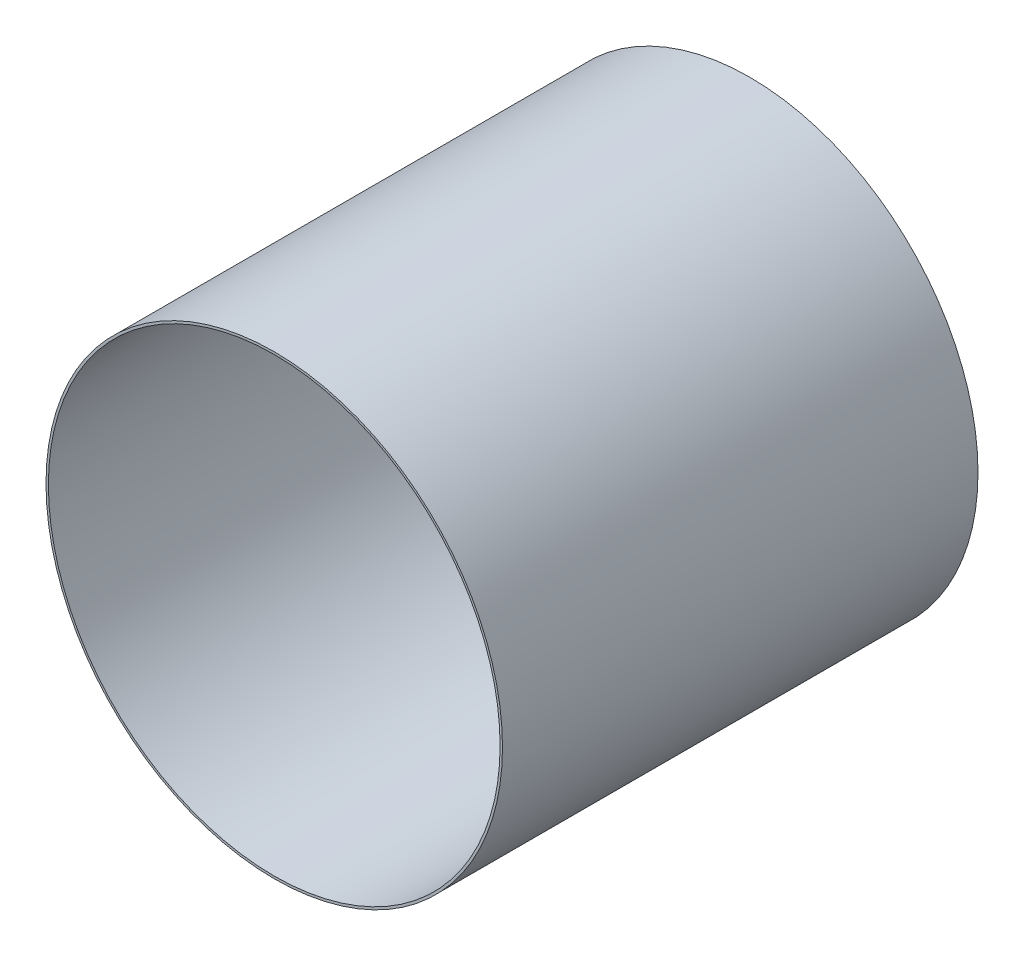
ISO-10303-21;
HEADER;
FILE_DESCRIPTION(('STEP AP214'),'2;1');
FILE_NAME('part.step','',(''),(''),'','','');
FILE_SCHEMA(('AUTOMOTIVE_DESIGN { 1 0 10303 214 1 1 1 1 }'));
ENDSEC;
DATA;
#1=APPLICATION_CONTEXT('core data for automotive mechanical design processes');
#2=APPLICATION_PROTOCOL_DEFINITION('international standard','automotive_design',2000,#1);
#3=PRODUCT_CONTEXT('',#1,'mechanical');
#4=PRODUCT('Part','Part','',(#3));
#5=PRODUCT_RELATED_PRODUCT_CATEGORY('part','',(#4));
#6=PRODUCT_DEFINITION_FORMATION('','',#4);
#7=PRODUCT_DEFINITION_CONTEXT('part definition',#1,'design');
#8=PRODUCT_DEFINITION('design','',#6,#7);
#9=PRODUCT_DEFINITION_SHAPE('','',#8);
#10=(LENGTH_UNIT() NAMED_UNIT(*) SI_UNIT(.MILLI.,.METRE.));
#11=(NAMED_UNIT(*) PLANE_ANGLE_UNIT() SI_UNIT($,.RADIAN.));
#12=(NAMED_UNIT(*) SI_UNIT($,.STERADIAN.) SOLID_ANGLE_UNIT());
#13=UNCERTAINTY_MEASURE_WITH_UNIT(LENGTH_MEASURE(1.E-05),#10,'distance_accuracy_value','');
#14=(GEOMETRIC_REPRESENTATION_CONTEXT(3) GLOBAL_UNCERTAINTY_ASSIGNED_CONTEXT((#13)) GLOBAL_UNIT_ASSIGNED_CONTEXT((#10,
#11,#12)) REPRESENTATION_CONTEXT('',''));
#15=CARTESIAN_POINT('',(0.,0.,0.));
#16=DIRECTION('',(0.,0.,1.));
#17=DIRECTION('',(1.,0.,0.));
#18=AXIS2_PLACEMENT_3D('',#15,#16,#17);
#19=CARTESIAN_POINT('',(0.,0.,-40.));
#20=DIRECTION('',(0.,0.,1.));
#21=DIRECTION('',(1.,0.,0.));
#22=AXIS2_PLACEMENT_3D('',#19,#20,#21);
#23=CYLINDRICAL_SURFACE('',#22,19.2);
#24=CARTESIAN_POINT('',(0.,0.,-40.));
#25=DIRECTION('',(0.,0.,1.));
#26=DIRECTION('',(1.,0.,0.));
#27=AXIS2_PLACEMENT_3D('',#24,#25,#26);
#28=CIRCLE('',#27,19.2);
#29=CARTESIAN_POINT('',(19.2,0.,-40.));
#30=VERTEX_POINT('',#29);
#31=EDGE_CURVE('E10',#30,#30,#28,.T.);
#32=ORIENTED_EDGE('',*,*,#31,.T.);
#33=EDGE_LOOP('',(#32));
#34=FACE_BOUND('',#33,.T.);
#35=CARTESIAN_POINT('',(0.,0.,0.));
#36=DIRECTION('',(0.,0.,1.));
#37=DIRECTION('',(1.,0.,0.));
#38=AXIS2_PLACEMENT_3D('',#35,#36,#37);
#39=CIRCLE('',#38,19.2);
#40=CARTESIAN_POINT('',(19.2,0.,0.));
#41=VERTEX_POINT('',#40);
#42=EDGE_CURVE('E40',#41,#41,#39,.T.);
#43=ORIENTED_EDGE('',*,*,#42,.F.);
#44=EDGE_LOOP('',(#43));
#45=FACE_BOUND('',#44,.T.);
#46=ADVANCED_FACE('F37',(#34,#45),#23,.T.);
#47=CARTESIAN_POINT('',(0.,0.,-40.));
#48=DIRECTION('',(0.,0.,1.));
#49=DIRECTION('',(1.,0.,0.));
#50=AXIS2_PLACEMENT_3D('',#47,#48,#49);
#51=PLANE('',#50);
#52=CARTESIAN_POINT('',(0.,0.,-40.));
#53=DIRECTION('',(0.,0.,1.));
#54=DIRECTION('',(1.,0.,0.));
#55=AXIS2_PLACEMENT_3D('',#52,#53,#54);
#56=CIRCLE('',#55,19.);
#57=CARTESIAN_POINT('',(19.,0.,-40.));
#58=VERTEX_POINT('',#57);
#59=EDGE_CURVE('E47',#58,#58,#56,.T.);
#60=ORIENTED_EDGE('',*,*,#59,.T.);
#61=EDGE_LOOP('',(#60));
#62=FACE_BOUND('',#61,.T.);
#63=ORIENTED_EDGE('',*,*,#31,.F.);
#64=EDGE_LOOP('',(#63));
#65=FACE_BOUND('',#64,.T.);
#66=ADVANCED_FACE('F55',(#62,#65),#51,.F.);
#67=CARTESIAN_POINT('',(0.,0.,0.));
#68=DIRECTION('',(0.,0.,1.));
#69=DIRECTION('',(1.,0.,0.));
#70=AXIS2_PLACEMENT_3D('',#67,#68,#69);
#71=PLANE('',#70);
#72=CARTESIAN_POINT('',(0.,0.,0.));
#73=DIRECTION('',(0.,0.,1.));
#74=DIRECTION('',(1.,0.,0.));
#75=AXIS2_PLACEMENT_3D('',#72,#73,#74);
#76=CIRCLE('',#75,19.);
#77=CARTESIAN_POINT('',(19.,0.,0.));
#78=VERTEX_POINT('',#77);
#79=EDGE_CURVE('E49',#78,#78,#76,.T.);
#80=ORIENTED_EDGE('',*,*,#79,.F.);
#81=EDGE_LOOP('',(#80));
#82=FACE_BOUND('',#81,.T.);
#83=ORIENTED_EDGE('',*,*,#42,.T.);
#84=EDGE_LOOP('',(#83));
#85=FACE_BOUND('',#84,.T.);
#86=ADVANCED_FACE('F61',(#82,#85),#71,.T.);
#87=CARTESIAN_POINT('',(0.,0.,-40.));
#88=DIRECTION('',(0.,0.,1.));
#89=DIRECTION('',(1.,0.,0.));
#90=AXIS2_PLACEMENT_3D('',#87,#88,#89);
#91=CYLINDRICAL_SURFACE('',#90,19.);
#92=ORIENTED_EDGE('',*,*,#59,.F.);
#93=EDGE_LOOP('',(#92));
#94=FACE_BOUND('',#93,.T.);
#95=ORIENTED_EDGE('',*,*,#79,.T.);
#96=EDGE_LOOP('',(#95));
#97=FACE_BOUND('',#96,.T.);
#98=ADVANCED_FACE('F58',(#94,#97),#91,.F.);
#99=CLOSED_SHELL('',(#46,#66,#86,#98));
#100=MANIFOLD_SOLID_BREP('B2',#99);
#101=ADVANCED_BREP_SHAPE_REPRESENTATION('',(#18,#100),#14);
#102=SHAPE_DEFINITION_REPRESENTATION(#9,#101);
ENDSEC;
END-ISO-10303-21;
